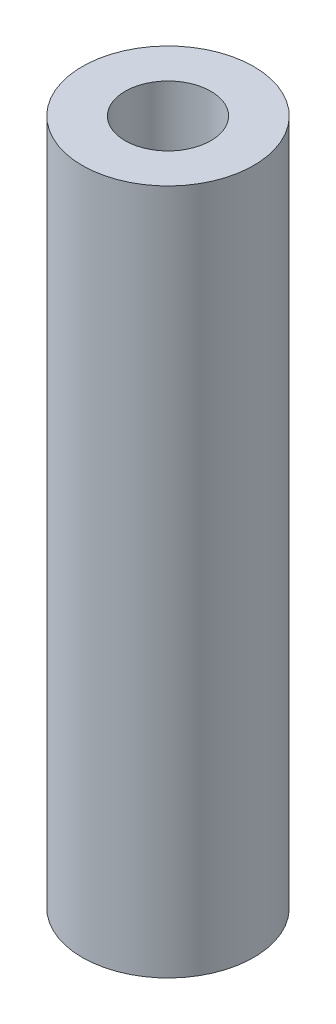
from build123d import *

# Parameters (mm, degrees)
SKETCH1_R   = 3.175
SKETCH1_R_2 = 1.5875


with BuildPart() as part:
    # Sweep1: sweep along a path in Sketch2
    with BuildLine(Plane.XY) as sweep1_path:
        Line((0, 0), (0, 25.4))
    # Sketch1 → Sweep1 (sweep)
    with BuildSketch(Plane(origin=(0, 0, 0), x_dir=(1, 0, 0), z_dir=(0, 1, 0))):
        Circle(SKETCH1_R)
        Circle(SKETCH1_R_2, mode=Mode.SUBTRACT)
    sweep(path=sweep1_path.line)


solid = part.part
